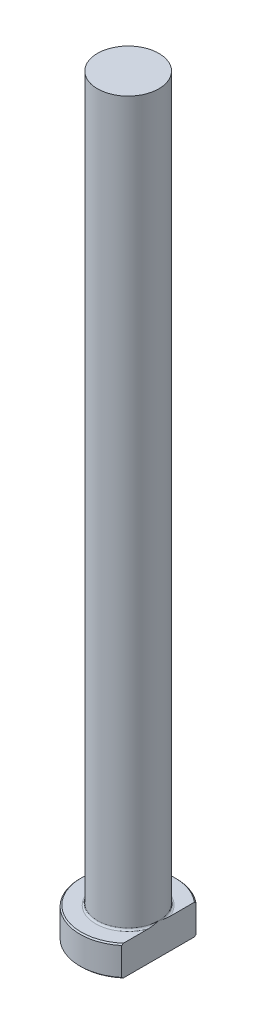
from build123d import *
from build123d.topology import SkipClean

# Parameters (mm, degrees)
CHAMFER1_SIZE = 0.2
FILLET1_R     = 0.3
KEY_DEPTH     = 126.510955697


with BuildPart() as part:
    # Sketch1 → Revolve1 (revolve)
    with BuildSketch(Plane.XY, mode=Mode.PRIVATE) as revolve1_sk:
        Polygon((0, 0), (-8, 0), (-8, 5), (-5.1, 5), (-5.1, 125), (0, 125), align=None)
    revolve(revolve1_sk.sketch.rotate(Axis((0, 259.958771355, 0), (0, -1, 0)), 270), axis=Axis((0, 259.958771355, 0), (0, -1, 0)))

    # Chamfer1
    chamfer1_edges = [part.edges().sort_by_distance(p)[0] for p in [
        (0, 5, -8),
        (0, 0, -8),
    ]]
    chamfer(chamfer1_edges, length=CHAMFER1_SIZE)

    # Fillet1
    fillet1_edges = [part.edges().sort_by_distance(p)[0] for p in [
        (0, 5, -5.1),
    ]]
    fillet(fillet1_edges, radius=FILLET1_R)

    # Sketch2 → KEY (cut, through all)
    with SkipClean():  # the faces are left unmerged after this step: merging them gives an invalid solid
        with BuildSketch(Plane(origin=(0, 0, 0), x_dir=(1, 0, 0), z_dir=(0, 1, 0))):
            with BuildLine():
                Line((5.1, 6.163602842), (5.1, -6.163602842))
                ThreePointArc((5.1, -6.163602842), (8, 0), (5.1, 6.163602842))
            make_face()
        extrude(amount=KEY_DEPTH, mode=Mode.SUBTRACT)


solid = part.part
